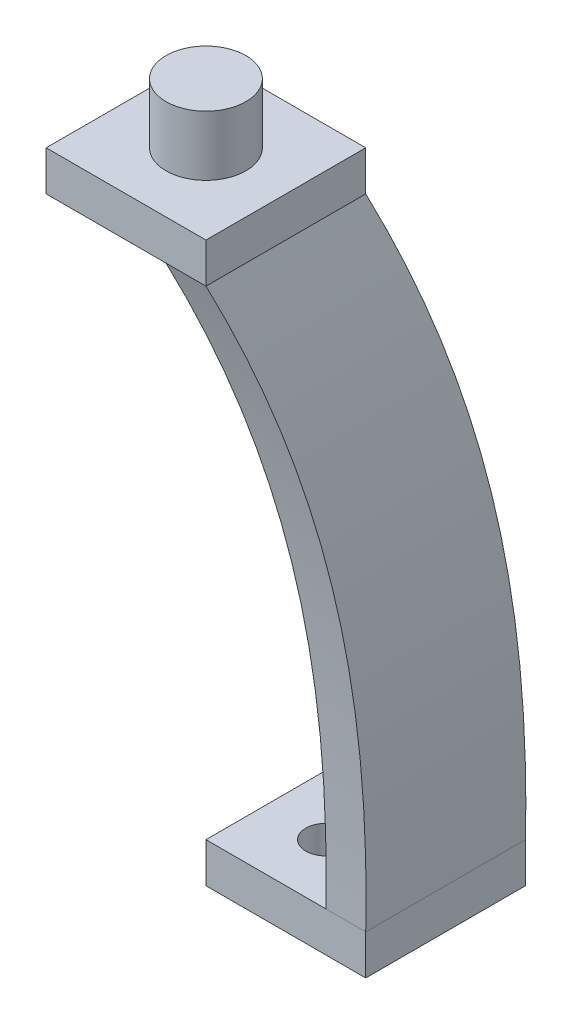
ISO-10303-21;
HEADER;
FILE_DESCRIPTION(('STEP AP214'),'2;1');
FILE_NAME('part.step','',(''),(''),'','','');
FILE_SCHEMA(('AUTOMOTIVE_DESIGN { 1 0 10303 214 1 1 1 1 }'));
ENDSEC;
DATA;
#1=APPLICATION_CONTEXT('core data for automotive mechanical design processes');
#2=APPLICATION_PROTOCOL_DEFINITION('international standard','automotive_design',2000,#1);
#3=PRODUCT_CONTEXT('',#1,'mechanical');
#4=PRODUCT('Part','Part','',(#3));
#5=PRODUCT_RELATED_PRODUCT_CATEGORY('part','',(#4));
#6=PRODUCT_DEFINITION_FORMATION('','',#4);
#7=PRODUCT_DEFINITION_CONTEXT('part definition',#1,'design');
#8=PRODUCT_DEFINITION('design','',#6,#7);
#9=PRODUCT_DEFINITION_SHAPE('','',#8);
#10=(LENGTH_UNIT() NAMED_UNIT(*) SI_UNIT(.MILLI.,.METRE.));
#11=(NAMED_UNIT(*) PLANE_ANGLE_UNIT() SI_UNIT($,.RADIAN.));
#12=(NAMED_UNIT(*) SI_UNIT($,.STERADIAN.) SOLID_ANGLE_UNIT());
#13=UNCERTAINTY_MEASURE_WITH_UNIT(LENGTH_MEASURE(1.E-05),#10,'distance_accuracy_value','');
#14=(GEOMETRIC_REPRESENTATION_CONTEXT(3) GLOBAL_UNCERTAINTY_ASSIGNED_CONTEXT((#13)) GLOBAL_UNIT_ASSIGNED_CONTEXT((#10,
#11,#12)) REPRESENTATION_CONTEXT('',''));
#15=CARTESIAN_POINT('',(0.,0.,0.));
#16=DIRECTION('',(0.,0.,1.));
#17=DIRECTION('',(1.,0.,0.));
#18=AXIS2_PLACEMENT_3D('',#15,#16,#17);
#19=CARTESIAN_POINT('',(17.7914220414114,15.4327005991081,48.4618992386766));
#20=DIRECTION('',(-1.,0.,0.));
#21=DIRECTION('',(0.,0.,1.));
#22=AXIS2_PLACEMENT_3D('',#19,#20,#21);
#23=PLANE('',#22);
#24=DIRECTION('',(0.,0.,-1.));
#25=VECTOR('',#24,1.);
#26=CARTESIAN_POINT('',(17.7914220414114,12.2577005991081,48.4618992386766));
#27=LINE('',#26,#25);
#28=CARTESIAN_POINT('',(17.7914220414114,12.2577005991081,48.4618992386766));
#29=VERTEX_POINT('',#28);
#30=CARTESIAN_POINT('',(17.7914220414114,12.2577005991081,35.7618992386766));
#31=VERTEX_POINT('',#30);
#32=EDGE_CURVE('P0_E79',#29,#31,#27,.T.);
#33=ORIENTED_EDGE('',*,*,#32,.T.);
#34=DIRECTION('',(0.,-1.,0.));
#35=VECTOR('',#34,1.);
#36=CARTESIAN_POINT('',(17.7914220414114,15.4327005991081,35.7618992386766));
#37=LINE('',#36,#35);
#38=CARTESIAN_POINT('',(17.7914220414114,15.4327005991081,35.7618992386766));
#39=VERTEX_POINT('',#38);
#40=EDGE_CURVE('P0_E10',#39,#31,#37,.T.);
#41=ORIENTED_EDGE('',*,*,#40,.F.);
#42=DIRECTION('',(0.,0.,-1.));
#43=VECTOR('',#42,1.);
#44=CARTESIAN_POINT('',(17.7914220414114,15.4327005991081,48.4618992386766));
#45=LINE('',#44,#43);
#46=CARTESIAN_POINT('',(17.7914220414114,15.4327005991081,48.4618992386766));
#47=VERTEX_POINT('',#46);
#48=EDGE_CURVE('P0_E67',#47,#39,#45,.T.);
#49=ORIENTED_EDGE('',*,*,#48,.F.);
#50=DIRECTION('',(0.,-1.,0.));
#51=VECTOR('',#50,1.);
#52=CARTESIAN_POINT('',(17.7914220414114,15.4327005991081,48.4618992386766));
#53=LINE('',#52,#51);
#54=EDGE_CURVE('P0_E75',#47,#29,#53,.T.);
#55=ORIENTED_EDGE('',*,*,#54,.T.);
#56=EDGE_LOOP('',(#33,#41,#49,#55));
#57=FACE_BOUND('',#56,.T.);
#58=ADVANCED_FACE('P0_F16',(#57),#23,.F.);
#59=CARTESIAN_POINT('',(5.09142204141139,15.4327005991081,35.7618992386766));
#60=DIRECTION('',(0.,0.,1.));
#61=DIRECTION('',(1.,0.,0.));
#62=AXIS2_PLACEMENT_3D('',#59,#60,#61);
#63=PLANE('',#62);
#64=DIRECTION('',(-1.,0.,0.));
#65=VECTOR('',#64,1.);
#66=CARTESIAN_POINT('',(5.09142204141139,12.2577005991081,35.7618992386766));
#67=LINE('',#66,#65);
#68=CARTESIAN_POINT('',(5.09142204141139,12.2577005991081,35.7618992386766));
#69=VERTEX_POINT('',#68);
#70=EDGE_CURVE('P0_E71',#31,#69,#67,.T.);
#71=ORIENTED_EDGE('',*,*,#70,.T.);
#72=DIRECTION('',(0.,-1.,0.));
#73=VECTOR('',#72,1.);
#74=CARTESIAN_POINT('',(5.09142204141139,15.4327005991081,35.7618992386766));
#75=LINE('',#74,#73);
#76=CARTESIAN_POINT('',(5.09142204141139,15.4327005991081,35.7618992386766));
#77=VERTEX_POINT('',#76);
#78=EDGE_CURVE('P0_E24',#77,#69,#75,.T.);
#79=ORIENTED_EDGE('',*,*,#78,.F.);
#80=DIRECTION('',(-1.,0.,0.));
#81=VECTOR('',#80,1.);
#82=CARTESIAN_POINT('',(5.09142204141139,15.4327005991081,35.7618992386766));
#83=LINE('',#82,#81);
#84=EDGE_CURVE('P0_E62',#39,#77,#83,.T.);
#85=ORIENTED_EDGE('',*,*,#84,.F.);
#86=ORIENTED_EDGE('',*,*,#40,.T.);
#87=EDGE_LOOP('',(#71,#79,#85,#86));
#88=FACE_BOUND('',#87,.T.);
#89=ADVANCED_FACE('P0_F70',(#88),#63,.F.);
#90=CARTESIAN_POINT('',(5.09142204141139,15.4327005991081,48.4618992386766));
#91=DIRECTION('',(1.,0.,0.));
#92=DIRECTION('',(0.,0.,-1.));
#93=AXIS2_PLACEMENT_3D('',#90,#91,#92);
#94=PLANE('',#93);
#95=DIRECTION('',(0.,0.,1.));
#96=VECTOR('',#95,1.);
#97=CARTESIAN_POINT('',(5.09142204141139,12.2577005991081,48.4618992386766));
#98=LINE('',#97,#96);
#99=CARTESIAN_POINT('',(5.09142204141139,12.2577005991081,48.4618992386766));
#100=VERTEX_POINT('',#99);
#101=EDGE_CURVE('P0_E49',#69,#100,#98,.T.);
#102=ORIENTED_EDGE('',*,*,#101,.T.);
#103=DIRECTION('',(0.,-1.,0.));
#104=VECTOR('',#103,1.);
#105=CARTESIAN_POINT('',(5.09142204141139,15.4327005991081,48.4618992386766));
#106=LINE('',#105,#104);
#107=CARTESIAN_POINT('',(5.09142204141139,15.4327005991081,48.4618992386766));
#108=VERTEX_POINT('',#107);
#109=EDGE_CURVE('P0_E72',#108,#100,#106,.T.);
#110=ORIENTED_EDGE('',*,*,#109,.F.);
#111=DIRECTION('',(0.,0.,1.));
#112=VECTOR('',#111,1.);
#113=CARTESIAN_POINT('',(5.09142204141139,15.4327005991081,48.4618992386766));
#114=LINE('',#113,#112);
#115=EDGE_CURVE('P0_E65',#77,#108,#114,.T.);
#116=ORIENTED_EDGE('',*,*,#115,.F.);
#117=ORIENTED_EDGE('',*,*,#78,.T.);
#118=EDGE_LOOP('',(#102,#110,#116,#117));
#119=FACE_BOUND('',#118,.T.);
#120=ADVANCED_FACE('P0_F73',(#119),#94,.F.);
#121=CARTESIAN_POINT('',(5.09142204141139,15.4327005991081,48.4618992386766));
#122=DIRECTION('',(0.,0.,-1.));
#123=DIRECTION('',(-1.,0.,0.));
#124=AXIS2_PLACEMENT_3D('',#121,#122,#123);
#125=PLANE('',#124);
#126=DIRECTION('',(1.,0.,0.));
#127=VECTOR('',#126,1.);
#128=CARTESIAN_POINT('',(5.09142204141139,12.2577005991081,48.4618992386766));
#129=LINE('',#128,#127);
#130=EDGE_CURVE('P0_E55',#100,#29,#129,.T.);
#131=ORIENTED_EDGE('',*,*,#130,.T.);
#132=ORIENTED_EDGE('',*,*,#54,.F.);
#133=DIRECTION('',(1.,0.,0.));
#134=VECTOR('',#133,1.);
#135=CARTESIAN_POINT('',(5.09142204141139,15.4327005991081,48.4618992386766));
#136=LINE('',#135,#134);
#137=EDGE_CURVE('P0_E32',#108,#47,#136,.T.);
#138=ORIENTED_EDGE('',*,*,#137,.F.);
#139=ORIENTED_EDGE('',*,*,#109,.T.);
#140=EDGE_LOOP('',(#131,#132,#138,#139));
#141=FACE_BOUND('',#140,.T.);
#142=ADVANCED_FACE('P0_F87',(#141),#125,.F.);
#143=CARTESIAN_POINT('',(11.4414220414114,15.4327005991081,42.1118992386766));
#144=DIRECTION('',(0.,-1.,0.));
#145=DIRECTION('',(0.,0.,-1.));
#146=AXIS2_PLACEMENT_3D('',#143,#144,#145);
#147=PLANE('',#146);
#148=CARTESIAN_POINT('',(9.85392204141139,15.4327005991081,43.6993992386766));
#149=DIRECTION('',(0.,1.,0.));
#150=DIRECTION('',(0.,0.,1.));
#151=AXIS2_PLACEMENT_3D('',#148,#149,#150);
#152=CIRCLE('',#151,1.5875);
#153=CARTESIAN_POINT('',(9.85392204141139,15.4327005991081,45.2868992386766));
#154=VERTEX_POINT('',#153);
#155=EDGE_CURVE('P0_E93',#154,#154,#152,.T.);
#156=ORIENTED_EDGE('',*,*,#155,.F.);
#157=EDGE_LOOP('',(#156));
#158=FACE_BOUND('',#157,.T.);
#159=ORIENTED_EDGE('',*,*,#48,.T.);
#160=ORIENTED_EDGE('',*,*,#84,.T.);
#161=ORIENTED_EDGE('',*,*,#115,.T.);
#162=ORIENTED_EDGE('',*,*,#137,.T.);
#163=EDGE_LOOP('',(#159,#160,#161,#162));
#164=FACE_BOUND('',#163,.T.);
#165=ADVANCED_FACE('P0_F63',(#158,#164),#147,.F.);
#166=CARTESIAN_POINT('',(11.4414220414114,12.2577005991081,42.1118992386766));
#167=DIRECTION('',(0.,-1.,0.));
#168=DIRECTION('',(0.,0.,-1.));
#169=AXIS2_PLACEMENT_3D('',#166,#167,#168);
#170=PLANE('',#169);
#171=CARTESIAN_POINT('',(9.85392204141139,12.2577005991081,43.6993992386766));
#172=DIRECTION('',(0.,1.,0.));
#173=DIRECTION('',(0.,0.,1.));
#174=AXIS2_PLACEMENT_3D('',#171,#172,#173);
#175=CIRCLE('',#174,1.5875);
#176=CARTESIAN_POINT('',(9.85392204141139,12.2577005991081,45.2868992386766));
#177=VERTEX_POINT('',#176);
#178=EDGE_CURVE('P0_E82',#177,#177,#175,.T.);
#179=ORIENTED_EDGE('',*,*,#178,.T.);
#180=EDGE_LOOP('',(#179));
#181=FACE_BOUND('',#180,.T.);
#182=ORIENTED_EDGE('',*,*,#32,.F.);
#183=ORIENTED_EDGE('',*,*,#130,.F.);
#184=ORIENTED_EDGE('',*,*,#101,.F.);
#185=ORIENTED_EDGE('',*,*,#70,.F.);
#186=EDGE_LOOP('',(#182,#183,#184,#185));
#187=FACE_BOUND('',#186,.T.);
#188=ADVANCED_FACE('P0_F90',(#181,#187),#170,.T.);
#189=CARTESIAN_POINT('',(9.85392204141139,12.2577005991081,43.6993992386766));
#190=DIRECTION('',(0.,1.,0.));
#191=DIRECTION('',(0.,0.,1.));
#192=AXIS2_PLACEMENT_3D('',#189,#190,#191);
#193=CYLINDRICAL_SURFACE('',#192,1.5875);
#194=ORIENTED_EDGE('',*,*,#178,.F.);
#195=EDGE_LOOP('',(#194));
#196=FACE_BOUND('',#195,.T.);
#197=ORIENTED_EDGE('',*,*,#155,.T.);
#198=EDGE_LOOP('',(#197));
#199=FACE_BOUND('',#198,.T.);
#200=ADVANCED_FACE('P0_F100',(#196,#199),#193,.F.);
#201=CLOSED_SHELL('',(#58,#89,#120,#142,#165,#188,#200));
#202=MANIFOLD_SOLID_BREP('P0_B1',#201);
#203=CARTESIAN_POINT('',(11.4414220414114,15.4327005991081,42.1118992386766));
#204=DIRECTION('',(0.,1.,0.));
#205=DIRECTION('',(0.,0.,1.));
#206=AXIS2_PLACEMENT_3D('',#203,#204,#205);
#207=PLANE('',#206);
#208=CARTESIAN_POINT('',(17.7914220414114,15.4327005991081,48.4618992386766));
#209=CARTESIAN_POINT('',(17.7914220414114,15.4327005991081,47.4035659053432));
#210=CARTESIAN_POINT('',(17.7914220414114,15.4327005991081,45.2868992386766));
#211=CARTESIAN_POINT('',(17.7914220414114,15.4327005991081,42.1118992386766));
#212=CARTESIAN_POINT('',(17.7914220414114,15.4327005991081,38.9368992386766));
#213=CARTESIAN_POINT('',(17.7914220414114,15.4327005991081,36.8202325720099));
#214=CARTESIAN_POINT('',(17.7914220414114,15.4327005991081,35.7618992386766));
#215=B_SPLINE_CURVE_WITH_KNOTS('',3,(#208,#209,#210,#211,#212,#213,#214),.UNSPECIFIED.,.F.,.F.,
(4,1,1,1,4),(0.,0.0625,0.125,0.1875,0.25),.UNSPECIFIED.);
#216=CARTESIAN_POINT('',(17.7914220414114,15.4327005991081,48.4618992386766));
#217=VERTEX_POINT('',#216);
#218=CARTESIAN_POINT('',(17.7914220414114,15.4327005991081,35.7618992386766));
#219=VERTEX_POINT('',#218);
#220=EDGE_CURVE('P1_E81',#217,#219,#215,.T.);
#221=ORIENTED_EDGE('',*,*,#220,.F.);
#222=CARTESIAN_POINT('',(14.6164220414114,15.4327005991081,48.4618992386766));
#223=CARTESIAN_POINT('',(14.8810053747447,15.4327005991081,48.4618992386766));
#224=CARTESIAN_POINT('',(15.4101720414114,15.4327005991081,48.4618992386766));
#225=CARTESIAN_POINT('',(16.2039220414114,15.4327005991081,48.4618992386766));
#226=CARTESIAN_POINT('',(16.9976720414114,15.4327005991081,48.4618992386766));
#227=CARTESIAN_POINT('',(17.5268387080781,15.4327005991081,48.4618992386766));
#228=CARTESIAN_POINT('',(17.7914220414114,15.4327005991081,48.4618992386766));
#229=B_SPLINE_CURVE_WITH_KNOTS('',3,(#222,#223,#224,#225,#226,#227,#228),.UNSPECIFIED.,.F.,.F.,
(4,1,1,1,4),(0.25,0.265625,0.28125,0.296875,0.3125),.UNSPECIFIED.);
#230=CARTESIAN_POINT('',(14.6164220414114,15.4327005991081,48.4618992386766));
#231=VERTEX_POINT('',#230);
#232=EDGE_CURVE('P1_E281',#231,#217,#229,.T.);
#233=ORIENTED_EDGE('',*,*,#232,.F.);
#234=CARTESIAN_POINT('',(14.6164220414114,15.4327005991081,38.9368992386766));
#235=CARTESIAN_POINT('',(14.6164220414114,15.4327005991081,39.7306492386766));
#236=CARTESIAN_POINT('',(14.6164220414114,15.4327005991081,41.3181492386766));
#237=CARTESIAN_POINT('',(14.6164220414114,15.4327005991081,43.6993992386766));
#238=CARTESIAN_POINT('',(14.6164220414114,15.4327005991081,46.0806492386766));
#239=CARTESIAN_POINT('',(14.6164220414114,15.4327005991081,47.6681492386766));
#240=CARTESIAN_POINT('',(14.6164220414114,15.4327005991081,48.4618992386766));
#241=B_SPLINE_CURVE_WITH_KNOTS('',3,(#234,#235,#236,#237,#238,#239,#240),.UNSPECIFIED.,.F.,.F.,
(4,1,1,1,4),(0.3125,0.359375,0.40625,0.453125,0.5),.UNSPECIFIED.);
#242=CARTESIAN_POINT('',(14.6164220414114,15.4327005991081,38.9368992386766));
#243=VERTEX_POINT('',#242);
#244=EDGE_CURVE('P1_E162',#243,#231,#241,.T.);
#245=ORIENTED_EDGE('',*,*,#244,.F.);
#246=CARTESIAN_POINT('',(5.09142204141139,15.4327005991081,38.9368992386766));
#247=CARTESIAN_POINT('',(5.88517204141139,15.4327005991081,38.9368992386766));
#248=CARTESIAN_POINT('',(7.47267204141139,15.4327005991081,38.9368992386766));
#249=CARTESIAN_POINT('',(9.8539220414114,15.4327005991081,38.9368992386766));
#250=CARTESIAN_POINT('',(12.2351720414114,15.4327005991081,38.9368992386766));
#251=CARTESIAN_POINT('',(13.8226720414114,15.4327005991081,38.9368992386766));
#252=CARTESIAN_POINT('',(14.6164220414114,15.4327005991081,38.9368992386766));
#253=B_SPLINE_CURVE_WITH_KNOTS('',3,(#246,#247,#248,#249,#250,#251,#252),.UNSPECIFIED.,.F.,.F.,
(4,1,1,1,4),(0.5,0.546875,0.59375,0.640625,0.6875),.UNSPECIFIED.);
#254=CARTESIAN_POINT('',(5.09142204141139,15.4327005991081,38.9368992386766));
#255=VERTEX_POINT('',#254);
#256=EDGE_CURVE('P1_E221',#255,#243,#253,.T.);
#257=ORIENTED_EDGE('',*,*,#256,.F.);
#258=CARTESIAN_POINT('',(5.09142204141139,15.4327005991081,35.7618992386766));
#259=CARTESIAN_POINT('',(5.09142204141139,15.4327005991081,36.0264825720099));
#260=CARTESIAN_POINT('',(5.09142204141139,15.4327005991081,36.5556492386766));
#261=CARTESIAN_POINT('',(5.09142204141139,15.4327005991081,37.3493992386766));
#262=CARTESIAN_POINT('',(5.09142204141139,15.4327005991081,38.1431492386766));
#263=CARTESIAN_POINT('',(5.09142204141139,15.4327005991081,38.6723159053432));
#264=CARTESIAN_POINT('',(5.09142204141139,15.4327005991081,38.9368992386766));
#265=B_SPLINE_CURVE_WITH_KNOTS('',3,(#258,#259,#260,#261,#262,#263,#264),.UNSPECIFIED.,.F.,.F.,
(4,1,1,1,4),(0.6875,0.703125,0.71875,0.734375,0.75),.UNSPECIFIED.);
#266=CARTESIAN_POINT('',(5.09142204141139,15.4327005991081,35.7618992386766));
#267=VERTEX_POINT('',#266);
#268=EDGE_CURVE('P1_E27',#267,#255,#265,.T.);
#269=ORIENTED_EDGE('',*,*,#268,.F.);
#270=CARTESIAN_POINT('',(17.7914220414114,15.4327005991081,35.7618992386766));
#271=CARTESIAN_POINT('',(16.7330887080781,15.4327005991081,35.7618992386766));
#272=CARTESIAN_POINT('',(14.6164220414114,15.4327005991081,35.7618992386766));
#273=CARTESIAN_POINT('',(11.4414220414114,15.4327005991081,35.7618992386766));
#274=CARTESIAN_POINT('',(8.26642204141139,15.4327005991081,35.7618992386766));
#275=CARTESIAN_POINT('',(6.14975537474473,15.4327005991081,35.7618992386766));
#276=CARTESIAN_POINT('',(5.09142204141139,15.4327005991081,35.7618992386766));
#277=B_SPLINE_CURVE_WITH_KNOTS('',3,(#270,#271,#272,#273,#274,#275,#276),.UNSPECIFIED.,.F.,.F.,
(4,1,1,1,4),(0.75,0.8125,0.875,0.9375,1.),.UNSPECIFIED.);
#278=EDGE_CURVE('P1_E11',#219,#267,#277,.T.);
#279=ORIENTED_EDGE('',*,*,#278,.F.);
#280=EDGE_LOOP('',(#221,#233,#245,#257,#269,#279));
#281=FACE_BOUND('',#280,.T.);
#282=ADVANCED_FACE('P1_F17',(#281),#207,.F.);
#283=CARTESIAN_POINT('',(11.4414220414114,59.8827005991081,42.1118992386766));
#284=DIRECTION('',(0.,-1.,0.));
#285=DIRECTION('',(0.,0.,-1.));
#286=AXIS2_PLACEMENT_3D('',#283,#284,#285);
#287=PLANE('',#286);
#288=CARTESIAN_POINT('',(11.4414220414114,59.8827005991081,42.1118992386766));
#289=CARTESIAN_POINT('',(11.4414220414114,59.8827005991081,43.1702325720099));
#290=CARTESIAN_POINT('',(11.4414220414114,59.8827005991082,45.2868992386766));
#291=CARTESIAN_POINT('',(11.4414220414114,59.882700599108,48.4618992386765));
#292=CARTESIAN_POINT('',(11.4414220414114,59.8827005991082,51.6368992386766));
#293=CARTESIAN_POINT('',(11.4414220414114,59.8827005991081,53.7535659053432));
#294=CARTESIAN_POINT('',(11.4414220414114,59.8827005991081,54.8118992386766));
#295=B_SPLINE_CURVE_WITH_KNOTS('',3,(#288,#289,#290,#291,#292,#293,#294),.UNSPECIFIED.,.F.,.F.,
(4,1,1,1,4),(0.,0.0625,0.125,0.1875,0.25),.UNSPECIFIED.);
#296=CARTESIAN_POINT('',(11.4414220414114,59.8827005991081,54.8118992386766));
#297=VERTEX_POINT('',#296);
#298=CARTESIAN_POINT('',(11.4414220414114,59.8827005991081,42.1118992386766));
#299=VERTEX_POINT('',#298);
#300=EDGE_CURVE('P1_E78',#297,#299,#295,.F.);
#301=ORIENTED_EDGE('',*,*,#300,.T.);
#302=CARTESIAN_POINT('',(-1.2585779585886,59.8827005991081,42.1118992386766));
#303=CARTESIAN_POINT('',(-0.20024462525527,59.8827005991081,42.1118992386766));
#304=CARTESIAN_POINT('',(1.91642204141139,59.8827005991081,42.1118992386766));
#305=CARTESIAN_POINT('',(5.0914220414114,59.8827005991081,42.1118992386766));
#306=CARTESIAN_POINT('',(8.2664220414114,59.8827005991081,42.1118992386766));
#307=CARTESIAN_POINT('',(10.3830887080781,59.8827005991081,42.1118992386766));
#308=CARTESIAN_POINT('',(11.4414220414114,59.8827005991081,42.1118992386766));
#309=B_SPLINE_CURVE_WITH_KNOTS('',3,(#302,#303,#304,#305,#306,#307,#308),.UNSPECIFIED.,.F.,.F.,
(4,1,1,1,4),(0.75,0.8125,0.875,0.9375,1.),.UNSPECIFIED.);
#310=CARTESIAN_POINT('',(-1.2585779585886,59.8827005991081,42.1118992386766));
#311=VERTEX_POINT('',#310);
#312=EDGE_CURVE('P1_E85',#299,#311,#309,.F.);
#313=ORIENTED_EDGE('',*,*,#312,.T.);
#314=CARTESIAN_POINT('',(-1.2585779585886,59.8827005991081,45.2868992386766));
#315=CARTESIAN_POINT('',(-1.2585779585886,59.8827005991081,45.0223159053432));
#316=CARTESIAN_POINT('',(-1.25857795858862,59.8827005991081,44.4931492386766));
#317=CARTESIAN_POINT('',(-1.25857795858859,59.8827005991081,43.6993992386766));
#318=CARTESIAN_POINT('',(-1.25857795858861,59.8827005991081,42.9056492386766));
#319=CARTESIAN_POINT('',(-1.25857795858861,59.8827005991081,42.3764825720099));
#320=CARTESIAN_POINT('',(-1.2585779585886,59.8827005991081,42.1118992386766));
#321=B_SPLINE_CURVE_WITH_KNOTS('',3,(#314,#315,#316,#317,#318,#319,#320),.UNSPECIFIED.,.F.,.F.,
(4,1,1,1,4),(0.6875,0.703125,0.71875,0.734375,0.75),.UNSPECIFIED.);
#322=CARTESIAN_POINT('',(-1.2585779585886,59.8827005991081,45.2868992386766));
#323=VERTEX_POINT('',#322);
#324=EDGE_CURVE('P1_E91',#311,#323,#321,.F.);
#325=ORIENTED_EDGE('',*,*,#324,.T.);
#326=CARTESIAN_POINT('',(8.2664220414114,59.8827005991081,45.2868992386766));
#327=CARTESIAN_POINT('',(7.4726720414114,59.8827005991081,45.2868992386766));
#328=CARTESIAN_POINT('',(5.88517204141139,59.8827005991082,45.2868992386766));
#329=CARTESIAN_POINT('',(3.50392204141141,59.882700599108,45.2868992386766));
#330=CARTESIAN_POINT('',(1.12267204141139,59.8827005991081,45.2868992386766));
#331=CARTESIAN_POINT('',(-0.464827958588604,59.8827005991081,45.2868992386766));
#332=CARTESIAN_POINT('',(-1.2585779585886,59.8827005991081,45.2868992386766));
#333=B_SPLINE_CURVE_WITH_KNOTS('',3,(#326,#327,#328,#329,#330,#331,#332),.UNSPECIFIED.,.F.,.F.,
(4,1,1,1,4),(0.5,0.546875,0.59375,0.640625,0.6875),.UNSPECIFIED.);
#334=CARTESIAN_POINT('',(8.2664220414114,59.8827005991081,45.2868992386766));
#335=VERTEX_POINT('',#334);
#336=EDGE_CURVE('P1_E146',#323,#335,#333,.F.);
#337=ORIENTED_EDGE('',*,*,#336,.T.);
#338=CARTESIAN_POINT('',(8.2664220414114,59.8827005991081,54.8118992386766));
#339=CARTESIAN_POINT('',(8.2664220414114,59.8827005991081,54.0181492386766));
#340=CARTESIAN_POINT('',(8.26642204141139,59.8827005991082,52.4306492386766));
#341=CARTESIAN_POINT('',(8.2664220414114,59.882700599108,50.0493992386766));
#342=CARTESIAN_POINT('',(8.2664220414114,59.8827005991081,47.6681492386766));
#343=CARTESIAN_POINT('',(8.2664220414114,59.8827005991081,46.0806492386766));
#344=CARTESIAN_POINT('',(8.2664220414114,59.8827005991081,45.2868992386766));
#345=B_SPLINE_CURVE_WITH_KNOTS('',3,(#338,#339,#340,#341,#342,#343,#344),.UNSPECIFIED.,.F.,.F.,
(4,1,1,1,4),(0.3125,0.359375,0.40625,0.453125,0.5),.UNSPECIFIED.);
#346=CARTESIAN_POINT('',(8.2664220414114,59.8827005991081,54.8118992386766));
#347=VERTEX_POINT('',#346);
#348=EDGE_CURVE('P1_E144',#335,#347,#345,.F.);
#349=ORIENTED_EDGE('',*,*,#348,.T.);
#350=CARTESIAN_POINT('',(11.4414220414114,59.8827005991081,54.8118992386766));
#351=CARTESIAN_POINT('',(11.1768387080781,59.8827005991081,54.8118992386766));
#352=CARTESIAN_POINT('',(10.6476720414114,59.8827005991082,54.8118992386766));
#353=CARTESIAN_POINT('',(9.8539220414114,59.882700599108,54.8118992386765));
#354=CARTESIAN_POINT('',(9.06017204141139,59.8827005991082,54.8118992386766));
#355=CARTESIAN_POINT('',(8.53100537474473,59.8827005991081,54.8118992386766));
#356=CARTESIAN_POINT('',(8.2664220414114,59.8827005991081,54.8118992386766));
#357=B_SPLINE_CURVE_WITH_KNOTS('',3,(#350,#351,#352,#353,#354,#355,#356),.UNSPECIFIED.,.F.,.F.,
(4,1,1,1,4),(0.25,0.265625,0.28125,0.296875,0.3125),.UNSPECIFIED.);
#358=EDGE_CURVE('P1_E96',#347,#297,#357,.F.);
#359=ORIENTED_EDGE('',*,*,#358,.T.);
#360=EDGE_LOOP('',(#301,#313,#325,#337,#349,#359));
#361=FACE_BOUND('',#360,.T.);
#362=ADVANCED_FACE('P1_F94',(#361),#287,.F.);
#363=CARTESIAN_POINT('',(-1.2585779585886,59.8827005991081,42.1118992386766));
#364=CARTESIAN_POINT('',(4.50560484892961,45.954904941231,37.5924098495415));
#365=CARTESIAN_POINT('',(5.60922898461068,31.4278798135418,35.949691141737));
#366=CARTESIAN_POINT('',(5.09142204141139,15.4327005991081,35.7618992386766));
#367=CARTESIAN_POINT('',(-0.20024462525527,59.8827005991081,42.1118992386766));
#368=CARTESIAN_POINT('',(5.56393818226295,45.954904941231,37.5924098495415));
#369=CARTESIAN_POINT('',(6.66756231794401,31.4278798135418,35.949691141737));
#370=CARTESIAN_POINT('',(6.14975537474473,15.4327005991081,35.7618992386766));
#371=CARTESIAN_POINT('',(1.91642204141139,59.8827005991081,42.1118992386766));
#372=CARTESIAN_POINT('',(7.68060484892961,45.954904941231,37.5924098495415));
#373=CARTESIAN_POINT('',(8.78422898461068,31.4278798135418,35.949691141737));
#374=CARTESIAN_POINT('',(8.26642204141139,15.4327005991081,35.7618992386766));
#375=CARTESIAN_POINT('',(5.0914220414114,59.8827005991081,42.1118992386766));
#376=CARTESIAN_POINT('',(10.8556048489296,45.9549049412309,37.5924098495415));
#377=CARTESIAN_POINT('',(11.9592289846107,31.4278798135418,35.949691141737));
#378=CARTESIAN_POINT('',(11.4414220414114,15.4327005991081,35.7618992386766));
#379=CARTESIAN_POINT('',(8.2664220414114,59.8827005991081,42.1118992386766));
#380=CARTESIAN_POINT('',(14.0306048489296,45.954904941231,37.5924098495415));
#381=CARTESIAN_POINT('',(15.1342289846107,31.4278798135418,35.949691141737));
#382=CARTESIAN_POINT('',(14.6164220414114,15.4327005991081,35.7618992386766));
#383=CARTESIAN_POINT('',(10.3830887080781,59.8827005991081,42.1118992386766));
#384=CARTESIAN_POINT('',(16.1472715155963,45.954904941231,37.5924098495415));
#385=CARTESIAN_POINT('',(17.2508956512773,31.4278798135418,35.949691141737));
#386=CARTESIAN_POINT('',(16.7330887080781,15.4327005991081,35.7618992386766));
#387=CARTESIAN_POINT('',(11.4414220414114,59.8827005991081,42.1118992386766));
#388=CARTESIAN_POINT('',(17.2056048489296,45.954904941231,37.5924098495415));
#389=CARTESIAN_POINT('',(18.3092289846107,31.4278798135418,35.949691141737));
#390=CARTESIAN_POINT('',(17.7914220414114,15.4327005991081,35.7618992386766));
#391=B_SPLINE_SURFACE_WITH_KNOTS('',3,3,((#363,#364,#365,#366),(#367,#368,#369,#370),(#371,#372,
#373,#374),(#375,#376,#377,#378),(#379,#380,#381,#382),(#383,#384,#385,#386),(#387,#388,#389,
#390)),.UNSPECIFIED.,.F.,.F.,.F.,(4,1,1,1,4),(4,4),(0.75,0.8125,0.875,0.9375,1.),(0.,1.),.UNSPECIFIED.);
#392=CARTESIAN_POINT('',(11.4414220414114,59.8827005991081,42.1118992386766));
#393=CARTESIAN_POINT('',(17.2056048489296,45.954904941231,37.5924098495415));
#394=CARTESIAN_POINT('',(18.3092289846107,31.4278798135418,35.949691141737));
#395=CARTESIAN_POINT('',(17.7914220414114,15.4327005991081,35.7618992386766));
#396=B_SPLINE_CURVE_WITH_KNOTS('',3,(#392,#393,#394,#395),.UNSPECIFIED.,.F.,.F.,(4,4),(0.,1.),.UNSPECIFIED.);
#397=EDGE_CURVE('P1_E73',#299,#219,#396,.T.);
#398=CARTESIAN_POINT('',(-1.2585779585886,59.8827005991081,42.1118992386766));
#399=CARTESIAN_POINT('',(4.50560484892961,45.954904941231,37.5924098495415));
#400=CARTESIAN_POINT('',(5.60922898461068,31.4278798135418,35.949691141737));
#401=CARTESIAN_POINT('',(5.09142204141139,15.4327005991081,35.7618992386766));
#402=B_SPLINE_CURVE_WITH_KNOTS('',3,(#398,#399,#400,#401),.UNSPECIFIED.,.F.,.F.,(4,4),(0.,1.),.UNSPECIFIED.);
#403=EDGE_CURVE('P1_E41',#311,#267,#402,.T.);
#404=ORIENTED_EDGE('',*,*,#312,.F.);
#405=ORIENTED_EDGE('',*,*,#397,.T.);
#406=ORIENTED_EDGE('',*,*,#278,.T.);
#407=ORIENTED_EDGE('',*,*,#403,.F.);
#408=EDGE_LOOP('',(#404,#405,#406,#407));
#409=FACE_BOUND('',#408,.T.);
#410=ADVANCED_FACE('P1_F87',(#409),#391,.T.);
#411=CARTESIAN_POINT('',(-1.2585779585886,59.8827005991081,45.2868992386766));
#412=CARTESIAN_POINT('',(4.50560484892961,45.954904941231,40.7674098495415));
#413=CARTESIAN_POINT('',(5.60922898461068,31.4278798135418,39.124691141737));
#414=CARTESIAN_POINT('',(5.09142204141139,15.4327005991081,38.9368992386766));
#415=CARTESIAN_POINT('',(-1.2585779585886,59.8827005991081,45.0223159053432));
#416=CARTESIAN_POINT('',(4.50560484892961,45.954904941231,40.5028265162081));
#417=CARTESIAN_POINT('',(5.60922898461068,31.4278798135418,38.8601078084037));
#418=CARTESIAN_POINT('',(5.09142204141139,15.4327005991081,38.6723159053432));
#419=CARTESIAN_POINT('',(-1.25857795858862,59.8827005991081,44.4931492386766));
#420=CARTESIAN_POINT('',(4.5056048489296,45.954904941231,39.9736598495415));
#421=CARTESIAN_POINT('',(5.60922898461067,31.4278798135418,38.330941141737));
#422=CARTESIAN_POINT('',(5.09142204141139,15.4327005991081,38.1431492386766));
#423=CARTESIAN_POINT('',(-1.25857795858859,59.8827005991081,43.6993992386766));
#424=CARTESIAN_POINT('',(4.50560484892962,45.954904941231,39.1799098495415));
#425=CARTESIAN_POINT('',(5.60922898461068,31.4278798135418,37.537191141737));
#426=CARTESIAN_POINT('',(5.09142204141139,15.4327005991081,37.3493992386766));
#427=CARTESIAN_POINT('',(-1.25857795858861,59.8827005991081,42.9056492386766));
#428=CARTESIAN_POINT('',(4.50560484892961,45.954904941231,38.3861598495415));
#429=CARTESIAN_POINT('',(5.60922898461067,31.4278798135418,36.743441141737));
#430=CARTESIAN_POINT('',(5.09142204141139,15.4327005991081,36.5556492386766));
#431=CARTESIAN_POINT('',(-1.25857795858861,59.8827005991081,42.3764825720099));
#432=CARTESIAN_POINT('',(4.50560484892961,45.954904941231,37.8569931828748));
#433=CARTESIAN_POINT('',(5.60922898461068,31.4278798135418,36.2142744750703));
#434=CARTESIAN_POINT('',(5.09142204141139,15.4327005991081,36.0264825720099));
#435=CARTESIAN_POINT('',(-1.2585779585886,59.8827005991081,42.1118992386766));
#436=CARTESIAN_POINT('',(4.50560484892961,45.954904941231,37.5924098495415));
#437=CARTESIAN_POINT('',(5.60922898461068,31.4278798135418,35.949691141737));
#438=CARTESIAN_POINT('',(5.09142204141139,15.4327005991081,35.7618992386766));
#439=B_SPLINE_SURFACE_WITH_KNOTS('',3,3,((#411,#412,#413,#414),(#415,#416,#417,#418),(#419,#420,
#421,#422),(#423,#424,#425,#426),(#427,#428,#429,#430),(#431,#432,#433,#434),(#435,#436,#437,
#438)),.UNSPECIFIED.,.F.,.F.,.F.,(4,1,1,1,4),(4,4),(0.6875,0.703125,0.71875,0.734375,0.75),(0.,
1.),.UNSPECIFIED.);
#440=CARTESIAN_POINT('',(-1.2585779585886,59.8827005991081,45.2868992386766));
#441=CARTESIAN_POINT('',(4.50560484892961,45.954904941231,40.7674098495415));
#442=CARTESIAN_POINT('',(5.60922898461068,31.4278798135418,39.124691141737));
#443=CARTESIAN_POINT('',(5.09142204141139,15.4327005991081,38.9368992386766));
#444=B_SPLINE_CURVE_WITH_KNOTS('',3,(#440,#441,#442,#443),.UNSPECIFIED.,.F.,.F.,(4,4),(0.,1.),.UNSPECIFIED.);
#445=EDGE_CURVE('P1_E166',#323,#255,#444,.T.);
#446=ORIENTED_EDGE('',*,*,#324,.F.);
#447=ORIENTED_EDGE('',*,*,#403,.T.);
#448=ORIENTED_EDGE('',*,*,#268,.T.);
#449=ORIENTED_EDGE('',*,*,#445,.F.);
#450=EDGE_LOOP('',(#446,#447,#448,#449));
#451=FACE_BOUND('',#450,.T.);
#452=ADVANCED_FACE('P1_F234',(#451),#439,.T.);
#453=CARTESIAN_POINT('',(8.2664220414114,59.8827005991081,45.2868992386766));
#454=CARTESIAN_POINT('',(14.0306048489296,45.954904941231,40.7674098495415));
#455=CARTESIAN_POINT('',(15.1342289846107,31.4278798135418,39.124691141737));
#456=CARTESIAN_POINT('',(14.6164220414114,15.4327005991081,38.9368992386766));
#457=CARTESIAN_POINT('',(7.4726720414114,59.8827005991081,45.2868992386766));
#458=CARTESIAN_POINT('',(13.2368548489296,45.954904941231,40.7674098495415));
#459=CARTESIAN_POINT('',(14.3404789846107,31.4278798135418,39.124691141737));
#460=CARTESIAN_POINT('',(13.8226720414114,15.4327005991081,38.9368992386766));
#461=CARTESIAN_POINT('',(5.88517204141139,59.8827005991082,45.2868992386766));
#462=CARTESIAN_POINT('',(11.6493548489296,45.954904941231,40.7674098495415));
#463=CARTESIAN_POINT('',(12.7529789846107,31.4278798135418,39.124691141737));
#464=CARTESIAN_POINT('',(12.2351720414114,15.4327005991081,38.9368992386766));
#465=CARTESIAN_POINT('',(3.50392204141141,59.882700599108,45.2868992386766));
#466=CARTESIAN_POINT('',(9.26810484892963,45.9549049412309,40.7674098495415));
#467=CARTESIAN_POINT('',(10.3717289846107,31.4278798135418,39.124691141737));
#468=CARTESIAN_POINT('',(9.8539220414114,15.4327005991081,38.9368992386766));
#469=CARTESIAN_POINT('',(1.12267204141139,59.8827005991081,45.2868992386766));
#470=CARTESIAN_POINT('',(6.88685484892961,45.954904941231,40.7674098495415));
#471=CARTESIAN_POINT('',(7.99047898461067,31.4278798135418,39.124691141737));
#472=CARTESIAN_POINT('',(7.47267204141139,15.4327005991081,38.9368992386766));
#473=CARTESIAN_POINT('',(-0.464827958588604,59.8827005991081,45.2868992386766));
#474=CARTESIAN_POINT('',(5.29935484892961,45.954904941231,40.7674098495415));
#475=CARTESIAN_POINT('',(6.40297898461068,31.4278798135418,39.124691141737));
#476=CARTESIAN_POINT('',(5.88517204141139,15.4327005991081,38.9368992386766));
#477=CARTESIAN_POINT('',(-1.2585779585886,59.8827005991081,45.2868992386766));
#478=CARTESIAN_POINT('',(4.50560484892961,45.954904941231,40.7674098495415));
#479=CARTESIAN_POINT('',(5.60922898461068,31.4278798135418,39.124691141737));
#480=CARTESIAN_POINT('',(5.09142204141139,15.4327005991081,38.9368992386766));
#481=B_SPLINE_SURFACE_WITH_KNOTS('',3,3,((#453,#454,#455,#456),(#457,#458,#459,#460),(#461,#462,
#463,#464),(#465,#466,#467,#468),(#469,#470,#471,#472),(#473,#474,#475,#476),(#477,#478,#479,
#480)),.UNSPECIFIED.,.F.,.F.,.F.,(4,1,1,1,4),(4,4),(0.5,0.546875,0.59375,0.640625,0.6875),(0.,
1.),.UNSPECIFIED.);
#482=CARTESIAN_POINT('',(8.2664220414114,59.8827005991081,45.2868992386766));
#483=CARTESIAN_POINT('',(14.0306048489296,45.954904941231,40.7674098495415));
#484=CARTESIAN_POINT('',(15.1342289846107,31.4278798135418,39.124691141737));
#485=CARTESIAN_POINT('',(14.6164220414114,15.4327005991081,38.9368992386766));
#486=B_SPLINE_CURVE_WITH_KNOTS('',3,(#482,#483,#484,#485),.UNSPECIFIED.,.F.,.F.,(4,4),(0.,1.),.UNSPECIFIED.);
#487=EDGE_CURVE('P1_E164',#335,#243,#486,.T.);
#488=ORIENTED_EDGE('',*,*,#336,.F.);
#489=ORIENTED_EDGE('',*,*,#445,.T.);
#490=ORIENTED_EDGE('',*,*,#256,.T.);
#491=ORIENTED_EDGE('',*,*,#487,.F.);
#492=EDGE_LOOP('',(#488,#489,#490,#491));
#493=FACE_BOUND('',#492,.T.);
#494=ADVANCED_FACE('P1_F193',(#493),#481,.T.);
#495=CARTESIAN_POINT('',(8.2664220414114,59.8827005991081,54.8118992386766));
#496=CARTESIAN_POINT('',(14.0306048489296,45.954904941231,50.2924098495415));
#497=CARTESIAN_POINT('',(15.1342289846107,31.4278798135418,48.649691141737));
#498=CARTESIAN_POINT('',(14.6164220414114,15.4327005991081,48.4618992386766));
#499=CARTESIAN_POINT('',(8.2664220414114,59.8827005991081,54.0181492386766));
#500=CARTESIAN_POINT('',(14.0306048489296,45.954904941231,49.4986598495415));
#501=CARTESIAN_POINT('',(15.1342289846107,31.4278798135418,47.855941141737));
#502=CARTESIAN_POINT('',(14.6164220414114,15.4327005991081,47.6681492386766));
#503=CARTESIAN_POINT('',(8.26642204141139,59.8827005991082,52.4306492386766));
#504=CARTESIAN_POINT('',(14.0306048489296,45.954904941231,47.9111598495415));
#505=CARTESIAN_POINT('',(15.1342289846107,31.4278798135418,46.268441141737));
#506=CARTESIAN_POINT('',(14.6164220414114,15.4327005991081,46.0806492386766));
#507=CARTESIAN_POINT('',(8.2664220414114,59.882700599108,50.0493992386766));
#508=CARTESIAN_POINT('',(14.0306048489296,45.9549049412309,45.5299098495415));
#509=CARTESIAN_POINT('',(15.1342289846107,31.4278798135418,43.887191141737));
#510=CARTESIAN_POINT('',(14.6164220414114,15.4327005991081,43.6993992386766));
#511=CARTESIAN_POINT('',(8.2664220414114,59.8827005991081,47.6681492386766));
#512=CARTESIAN_POINT('',(14.0306048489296,45.954904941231,43.1486598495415));
#513=CARTESIAN_POINT('',(15.1342289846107,31.4278798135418,41.505941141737));
#514=CARTESIAN_POINT('',(14.6164220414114,15.4327005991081,41.3181492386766));
#515=CARTESIAN_POINT('',(8.2664220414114,59.8827005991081,46.0806492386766));
#516=CARTESIAN_POINT('',(14.0306048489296,45.954904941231,41.5611598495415));
#517=CARTESIAN_POINT('',(15.1342289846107,31.4278798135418,39.918441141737));
#518=CARTESIAN_POINT('',(14.6164220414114,15.4327005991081,39.7306492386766));
#519=CARTESIAN_POINT('',(8.2664220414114,59.8827005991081,45.2868992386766));
#520=CARTESIAN_POINT('',(14.0306048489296,45.954904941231,40.7674098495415));
#521=CARTESIAN_POINT('',(15.1342289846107,31.4278798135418,39.124691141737));
#522=CARTESIAN_POINT('',(14.6164220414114,15.4327005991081,38.9368992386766));
#523=B_SPLINE_SURFACE_WITH_KNOTS('',3,3,((#495,#496,#497,#498),(#499,#500,#501,#502),(#503,#504,
#505,#506),(#507,#508,#509,#510),(#511,#512,#513,#514),(#515,#516,#517,#518),(#519,#520,#521,
#522)),.UNSPECIFIED.,.F.,.F.,.F.,(4,1,1,1,4),(4,4),(0.3125,0.359375,0.40625,0.453125,0.5),(0.,
1.),.UNSPECIFIED.);
#524=CARTESIAN_POINT('',(8.2664220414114,59.8827005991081,54.8118992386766));
#525=CARTESIAN_POINT('',(14.0306048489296,45.954904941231,50.2924098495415));
#526=CARTESIAN_POINT('',(15.1342289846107,31.4278798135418,48.649691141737));
#527=CARTESIAN_POINT('',(14.6164220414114,15.4327005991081,48.4618992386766));
#528=B_SPLINE_CURVE_WITH_KNOTS('',3,(#524,#525,#526,#527),.UNSPECIFIED.,.F.,.F.,(4,4),(0.,1.),.UNSPECIFIED.);
#529=EDGE_CURVE('P1_E156',#347,#231,#528,.T.);
#530=ORIENTED_EDGE('',*,*,#348,.F.);
#531=ORIENTED_EDGE('',*,*,#487,.T.);
#532=ORIENTED_EDGE('',*,*,#244,.T.);
#533=ORIENTED_EDGE('',*,*,#529,.F.);
#534=EDGE_LOOP('',(#530,#531,#532,#533));
#535=FACE_BOUND('',#534,.T.);
#536=ADVANCED_FACE('P1_F160',(#535),#523,.T.);
#537=CARTESIAN_POINT('',(11.4414220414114,59.8827005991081,54.8118992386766));
#538=CARTESIAN_POINT('',(17.2056048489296,45.954904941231,50.2924098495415));
#539=CARTESIAN_POINT('',(18.3092289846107,31.4278798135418,48.649691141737));
#540=CARTESIAN_POINT('',(17.7914220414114,15.4327005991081,48.4618992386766));
#541=CARTESIAN_POINT('',(11.1768387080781,59.8827005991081,54.8118992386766));
#542=CARTESIAN_POINT('',(16.9410215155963,45.954904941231,50.2924098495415));
#543=CARTESIAN_POINT('',(18.0446456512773,31.4278798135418,48.649691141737));
#544=CARTESIAN_POINT('',(17.5268387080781,15.4327005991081,48.4618992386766));
#545=CARTESIAN_POINT('',(10.6476720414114,59.8827005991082,54.8118992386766));
#546=CARTESIAN_POINT('',(16.4118548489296,45.954904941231,50.2924098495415));
#547=CARTESIAN_POINT('',(17.5154789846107,31.4278798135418,48.649691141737));
#548=CARTESIAN_POINT('',(16.9976720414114,15.4327005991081,48.4618992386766));
#549=CARTESIAN_POINT('',(9.8539220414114,59.882700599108,54.8118992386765));
#550=CARTESIAN_POINT('',(15.6181048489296,45.9549049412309,50.2924098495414));
#551=CARTESIAN_POINT('',(16.7217289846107,31.4278798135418,48.649691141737));
#552=CARTESIAN_POINT('',(16.2039220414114,15.4327005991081,48.4618992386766));
#553=CARTESIAN_POINT('',(9.06017204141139,59.8827005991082,54.8118992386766));
#554=CARTESIAN_POINT('',(14.8243548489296,45.954904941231,50.2924098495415));
#555=CARTESIAN_POINT('',(15.9279789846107,31.4278798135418,48.649691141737));
#556=CARTESIAN_POINT('',(15.4101720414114,15.4327005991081,48.4618992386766));
#557=CARTESIAN_POINT('',(8.53100537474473,59.8827005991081,54.8118992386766));
#558=CARTESIAN_POINT('',(14.2951881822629,45.954904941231,50.2924098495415));
#559=CARTESIAN_POINT('',(15.398812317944,31.4278798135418,48.649691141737));
#560=CARTESIAN_POINT('',(14.8810053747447,15.4327005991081,48.4618992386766));
#561=CARTESIAN_POINT('',(8.2664220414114,59.8827005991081,54.8118992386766));
#562=CARTESIAN_POINT('',(14.0306048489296,45.954904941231,50.2924098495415));
#563=CARTESIAN_POINT('',(15.1342289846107,31.4278798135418,48.649691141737));
#564=CARTESIAN_POINT('',(14.6164220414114,15.4327005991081,48.4618992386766));
#565=B_SPLINE_SURFACE_WITH_KNOTS('',3,3,((#537,#538,#539,#540),(#541,#542,#543,#544),(#545,#546,
#547,#548),(#549,#550,#551,#552),(#553,#554,#555,#556),(#557,#558,#559,#560),(#561,#562,#563,
#564)),.UNSPECIFIED.,.F.,.F.,.F.,(4,1,1,1,4),(4,4),(0.25,0.265625,0.28125,0.296875,0.3125),(0.,
1.),.UNSPECIFIED.);
#566=CARTESIAN_POINT('',(11.4414220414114,59.8827005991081,54.8118992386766));
#567=CARTESIAN_POINT('',(17.2056048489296,45.954904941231,50.2924098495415));
#568=CARTESIAN_POINT('',(18.3092289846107,31.4278798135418,48.649691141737));
#569=CARTESIAN_POINT('',(17.7914220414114,15.4327005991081,48.4618992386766));
#570=B_SPLINE_CURVE_WITH_KNOTS('',3,(#566,#567,#568,#569),.UNSPECIFIED.,.F.,.F.,(4,4),(0.,1.),.UNSPECIFIED.);
#571=EDGE_CURVE('P1_E90',#297,#217,#570,.T.);
#572=ORIENTED_EDGE('',*,*,#358,.F.);
#573=ORIENTED_EDGE('',*,*,#529,.T.);
#574=ORIENTED_EDGE('',*,*,#232,.T.);
#575=ORIENTED_EDGE('',*,*,#571,.F.);
#576=EDGE_LOOP('',(#572,#573,#574,#575));
#577=FACE_BOUND('',#576,.T.);
#578=ADVANCED_FACE('P1_F155',(#577),#565,.T.);
#579=CARTESIAN_POINT('',(11.4414220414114,59.8827005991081,42.1118992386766));
#580=CARTESIAN_POINT('',(17.2056048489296,45.954904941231,37.5924098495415));
#581=CARTESIAN_POINT('',(18.3092289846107,31.4278798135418,35.949691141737));
#582=CARTESIAN_POINT('',(17.7914220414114,15.4327005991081,35.7618992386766));
#583=CARTESIAN_POINT('',(11.4414220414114,59.8827005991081,43.1702325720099));
#584=CARTESIAN_POINT('',(17.2056048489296,45.954904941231,38.6507431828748));
#585=CARTESIAN_POINT('',(18.3092289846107,31.4278798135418,37.0080244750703));
#586=CARTESIAN_POINT('',(17.7914220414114,15.4327005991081,36.8202325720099));
#587=CARTESIAN_POINT('',(11.4414220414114,59.8827005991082,45.2868992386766));
#588=CARTESIAN_POINT('',(17.2056048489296,45.954904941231,40.7674098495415));
#589=CARTESIAN_POINT('',(18.3092289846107,31.4278798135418,39.124691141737));
#590=CARTESIAN_POINT('',(17.7914220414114,15.4327005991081,38.9368992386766));
#591=CARTESIAN_POINT('',(11.4414220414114,59.882700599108,48.4618992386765));
#592=CARTESIAN_POINT('',(17.2056048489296,45.9549049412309,43.9424098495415));
#593=CARTESIAN_POINT('',(18.3092289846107,31.4278798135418,42.299691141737));
#594=CARTESIAN_POINT('',(17.7914220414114,15.4327005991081,42.1118992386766));
#595=CARTESIAN_POINT('',(11.4414220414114,59.8827005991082,51.6368992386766));
#596=CARTESIAN_POINT('',(17.2056048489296,45.954904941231,47.1174098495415));
#597=CARTESIAN_POINT('',(18.3092289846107,31.4278798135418,45.474691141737));
#598=CARTESIAN_POINT('',(17.7914220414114,15.4327005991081,45.2868992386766));
#599=CARTESIAN_POINT('',(11.4414220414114,59.8827005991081,53.7535659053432));
#600=CARTESIAN_POINT('',(17.2056048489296,45.954904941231,49.2340765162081));
#601=CARTESIAN_POINT('',(18.3092289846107,31.4278798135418,47.5913578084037));
#602=CARTESIAN_POINT('',(17.7914220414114,15.4327005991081,47.4035659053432));
#603=CARTESIAN_POINT('',(11.4414220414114,59.8827005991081,54.8118992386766));
#604=CARTESIAN_POINT('',(17.2056048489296,45.954904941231,50.2924098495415));
#605=CARTESIAN_POINT('',(18.3092289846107,31.4278798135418,48.649691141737));
#606=CARTESIAN_POINT('',(17.7914220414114,15.4327005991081,48.4618992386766));
#607=B_SPLINE_SURFACE_WITH_KNOTS('',3,3,((#579,#580,#581,#582),(#583,#584,#585,#586),(#587,#588,
#589,#590),(#591,#592,#593,#594),(#595,#596,#597,#598),(#599,#600,#601,#602),(#603,#604,#605,
#606)),.UNSPECIFIED.,.F.,.F.,.F.,(4,1,1,1,4),(4,4),(0.,0.0625,0.125,0.1875,0.25),(0.,1.),.UNSPECIFIED.);
#608=ORIENTED_EDGE('',*,*,#300,.F.);
#609=ORIENTED_EDGE('',*,*,#571,.T.);
#610=ORIENTED_EDGE('',*,*,#220,.T.);
#611=ORIENTED_EDGE('',*,*,#397,.F.);
#612=EDGE_LOOP('',(#608,#609,#610,#611));
#613=FACE_BOUND('',#612,.T.);
#614=ADVANCED_FACE('P1_F75',(#613),#607,.T.);
#615=CLOSED_SHELL('',(#282,#362,#410,#452,#494,#536,#578,#614));
#616=MANIFOLD_SOLID_BREP('P1_B1',#615);
#617=CARTESIAN_POINT('',(11.4414220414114,63.0577005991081,54.8118992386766));
#618=DIRECTION('',(-1.,0.,0.));
#619=DIRECTION('',(0.,0.,1.));
#620=AXIS2_PLACEMENT_3D('',#617,#618,#619);
#621=PLANE('',#620);
#622=DIRECTION('',(0.,0.,-1.));
#623=VECTOR('',#622,1.);
#624=CARTESIAN_POINT('',(11.4414220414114,59.8827005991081,54.8118992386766));
#625=LINE('',#624,#623);
#626=CARTESIAN_POINT('',(11.4414220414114,59.8827005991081,54.8118992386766));
#627=VERTEX_POINT('',#626);
#628=CARTESIAN_POINT('',(11.4414220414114,59.8827005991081,42.1118992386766));
#629=VERTEX_POINT('',#628);
#630=EDGE_CURVE('P2_E83',#627,#629,#625,.T.);
#631=ORIENTED_EDGE('',*,*,#630,.T.);
#632=DIRECTION('',(0.,-1.,0.));
#633=VECTOR('',#632,1.);
#634=CARTESIAN_POINT('',(11.4414220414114,63.0577005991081,42.1118992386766));
#635=LINE('',#634,#633);
#636=CARTESIAN_POINT('',(11.4414220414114,63.0577005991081,42.1118992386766));
#637=VERTEX_POINT('',#636);
#638=EDGE_CURVE('P2_E20',#637,#629,#635,.T.);
#639=ORIENTED_EDGE('',*,*,#638,.F.);
#640=DIRECTION('',(0.,0.,-1.));
#641=VECTOR('',#640,1.);
#642=CARTESIAN_POINT('',(11.4414220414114,63.0577005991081,54.8118992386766));
#643=LINE('',#642,#641);
#644=CARTESIAN_POINT('',(11.4414220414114,63.0577005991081,54.8118992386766));
#645=VERTEX_POINT('',#644);
#646=EDGE_CURVE('P2_E70',#645,#637,#643,.T.);
#647=ORIENTED_EDGE('',*,*,#646,.F.);
#648=DIRECTION('',(0.,-1.,0.));
#649=VECTOR('',#648,1.);
#650=CARTESIAN_POINT('',(11.4414220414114,63.0577005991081,54.8118992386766));
#651=LINE('',#650,#649);
#652=EDGE_CURVE('P2_E79',#645,#627,#651,.T.);
#653=ORIENTED_EDGE('',*,*,#652,.T.);
#654=EDGE_LOOP('',(#631,#639,#647,#653));
#655=FACE_BOUND('',#654,.T.);
#656=ADVANCED_FACE('P2_F17',(#655),#621,.F.);
#657=CARTESIAN_POINT('',(-1.2585779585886,63.0577005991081,42.1118992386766));
#658=DIRECTION('',(0.,0.,1.));
#659=DIRECTION('',(1.,0.,0.));
#660=AXIS2_PLACEMENT_3D('',#657,#658,#659);
#661=PLANE('',#660);
#662=DIRECTION('',(-1.,0.,0.));
#663=VECTOR('',#662,1.);
#664=CARTESIAN_POINT('',(-1.2585779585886,59.8827005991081,42.1118992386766));
#665=LINE('',#664,#663);
#666=CARTESIAN_POINT('',(-1.2585779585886,59.8827005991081,42.1118992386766));
#667=VERTEX_POINT('',#666);
#668=EDGE_CURVE('P2_E75',#629,#667,#665,.T.);
#669=ORIENTED_EDGE('',*,*,#668,.T.);
#670=DIRECTION('',(0.,-1.,0.));
#671=VECTOR('',#670,1.);
#672=CARTESIAN_POINT('',(-1.2585779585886,63.0577005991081,42.1118992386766));
#673=LINE('',#672,#671);
#674=CARTESIAN_POINT('',(-1.2585779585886,63.0577005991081,42.1118992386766));
#675=VERTEX_POINT('',#674);
#676=EDGE_CURVE('P2_E73',#675,#667,#673,.T.);
#677=ORIENTED_EDGE('',*,*,#676,.F.);
#678=DIRECTION('',(-1.,0.,0.));
#679=VECTOR('',#678,1.);
#680=CARTESIAN_POINT('',(-1.2585779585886,63.0577005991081,42.1118992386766));
#681=LINE('',#680,#679);
#682=EDGE_CURVE('P2_E65',#637,#675,#681,.T.);
#683=ORIENTED_EDGE('',*,*,#682,.F.);
#684=ORIENTED_EDGE('',*,*,#638,.T.);
#685=EDGE_LOOP('',(#669,#677,#683,#684));
#686=FACE_BOUND('',#685,.T.);
#687=ADVANCED_FACE('P2_F74',(#686),#661,.F.);
#688=CARTESIAN_POINT('',(-1.2585779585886,63.0577005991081,54.8118992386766));
#689=DIRECTION('',(1.,0.,0.));
#690=DIRECTION('',(0.,0.,-1.));
#691=AXIS2_PLACEMENT_3D('',#688,#689,#690);
#692=PLANE('',#691);
#693=DIRECTION('',(0.,0.,1.));
#694=VECTOR('',#693,1.);
#695=CARTESIAN_POINT('',(-1.2585779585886,59.8827005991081,54.8118992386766));
#696=LINE('',#695,#694);
#697=CARTESIAN_POINT('',(-1.2585779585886,59.8827005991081,54.8118992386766));
#698=VERTEX_POINT('',#697);
#699=EDGE_CURVE('P2_E51',#667,#698,#696,.T.);
#700=ORIENTED_EDGE('',*,*,#699,.T.);
#701=DIRECTION('',(0.,-1.,0.));
#702=VECTOR('',#701,1.);
#703=CARTESIAN_POINT('',(-1.2585779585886,63.0577005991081,54.8118992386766));
#704=LINE('',#703,#702);
#705=CARTESIAN_POINT('',(-1.2585779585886,63.0577005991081,54.8118992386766));
#706=VERTEX_POINT('',#705);
#707=EDGE_CURVE('P2_E76',#706,#698,#704,.T.);
#708=ORIENTED_EDGE('',*,*,#707,.F.);
#709=DIRECTION('',(0.,0.,1.));
#710=VECTOR('',#709,1.);
#711=CARTESIAN_POINT('',(-1.2585779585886,63.0577005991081,54.8118992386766));
#712=LINE('',#711,#710);
#713=EDGE_CURVE('P2_E68',#675,#706,#712,.T.);
#714=ORIENTED_EDGE('',*,*,#713,.F.);
#715=ORIENTED_EDGE('',*,*,#676,.T.);
#716=EDGE_LOOP('',(#700,#708,#714,#715));
#717=FACE_BOUND('',#716,.T.);
#718=ADVANCED_FACE('P2_F77',(#717),#692,.F.);
#719=CARTESIAN_POINT('',(-1.2585779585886,63.0577005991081,54.8118992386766));
#720=DIRECTION('',(0.,0.,-1.));
#721=DIRECTION('',(-1.,0.,0.));
#722=AXIS2_PLACEMENT_3D('',#719,#720,#721);
#723=PLANE('',#722);
#724=DIRECTION('',(1.,0.,0.));
#725=VECTOR('',#724,1.);
#726=CARTESIAN_POINT('',(-1.2585779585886,59.8827005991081,54.8118992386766));
#727=LINE('',#726,#725);
#728=EDGE_CURVE('P2_E57',#698,#627,#727,.T.);
#729=ORIENTED_EDGE('',*,*,#728,.T.);
#730=ORIENTED_EDGE('',*,*,#652,.F.);
#731=DIRECTION('',(1.,0.,0.));
#732=VECTOR('',#731,1.);
#733=CARTESIAN_POINT('',(-1.2585779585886,63.0577005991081,54.8118992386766));
#734=LINE('',#733,#732);
#735=EDGE_CURVE('P2_E34',#706,#645,#734,.T.);
#736=ORIENTED_EDGE('',*,*,#735,.F.);
#737=ORIENTED_EDGE('',*,*,#707,.T.);
#738=EDGE_LOOP('',(#729,#730,#736,#737));
#739=FACE_BOUND('',#738,.T.);
#740=ADVANCED_FACE('P2_F91',(#739),#723,.F.);
#741=CARTESIAN_POINT('',(5.0914220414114,63.0577005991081,48.4618992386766));
#742=DIRECTION('',(0.,-1.,0.));
#743=DIRECTION('',(0.,0.,-1.));
#744=AXIS2_PLACEMENT_3D('',#741,#742,#743);
#745=PLANE('',#744);
#746=CARTESIAN_POINT('',(5.0914220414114,63.0577005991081,48.4618992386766));
#747=DIRECTION('',(0.,1.,0.));
#748=DIRECTION('',(0.,0.,1.));
#749=AXIS2_PLACEMENT_3D('',#746,#747,#748);
#750=CIRCLE('',#749,3.175);
#751=CARTESIAN_POINT('',(5.0914220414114,63.0577005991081,51.6368992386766));
#752=VERTEX_POINT('',#751);
#753=EDGE_CURVE('P2_E11',#752,#752,#750,.T.);
#754=ORIENTED_EDGE('',*,*,#753,.F.);
#755=EDGE_LOOP('',(#754));
#756=FACE_BOUND('',#755,.T.);
#757=ORIENTED_EDGE('',*,*,#646,.T.);
#758=ORIENTED_EDGE('',*,*,#682,.T.);
#759=ORIENTED_EDGE('',*,*,#713,.T.);
#760=ORIENTED_EDGE('',*,*,#735,.T.);
#761=EDGE_LOOP('',(#757,#758,#759,#760));
#762=FACE_BOUND('',#761,.T.);
#763=ADVANCED_FACE('P2_F66',(#756,#762),#745,.F.);
#764=CARTESIAN_POINT('',(5.0914220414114,59.8827005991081,48.4618992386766));
#765=DIRECTION('',(0.,-1.,0.));
#766=DIRECTION('',(0.,0.,-1.));
#767=AXIS2_PLACEMENT_3D('',#764,#765,#766);
#768=PLANE('',#767);
#769=ORIENTED_EDGE('',*,*,#630,.F.);
#770=ORIENTED_EDGE('',*,*,#728,.F.);
#771=ORIENTED_EDGE('',*,*,#699,.F.);
#772=ORIENTED_EDGE('',*,*,#668,.F.);
#773=EDGE_LOOP('',(#769,#770,#771,#772));
#774=FACE_BOUND('',#773,.T.);
#775=ADVANCED_FACE('P2_F94',(#774),#768,.T.);
#776=CARTESIAN_POINT('',(5.0914220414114,67.8202005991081,48.4618992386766));
#777=DIRECTION('',(0.,-1.,0.));
#778=DIRECTION('',(0.,0.,-1.));
#779=AXIS2_PLACEMENT_3D('',#776,#777,#778);
#780=CYLINDRICAL_SURFACE('',#779,3.175);
#781=CARTESIAN_POINT('',(5.0914220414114,67.8202005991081,48.4618992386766));
#782=DIRECTION('',(0.,1.,0.));
#783=DIRECTION('',(0.,0.,1.));
#784=AXIS2_PLACEMENT_3D('',#781,#782,#783);
#785=CIRCLE('',#784,3.175);
#786=CARTESIAN_POINT('',(5.0914220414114,67.8202005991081,51.6368992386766));
#787=VERTEX_POINT('',#786);
#788=EDGE_CURVE('P2_E86',#787,#787,#785,.T.);
#789=ORIENTED_EDGE('',*,*,#788,.F.);
#790=EDGE_LOOP('',(#789));
#791=FACE_BOUND('',#790,.T.);
#792=ORIENTED_EDGE('',*,*,#753,.T.);
#793=EDGE_LOOP('',(#792));
#794=FACE_BOUND('',#793,.T.);
#795=ADVANCED_FACE('P2_F102',(#791,#794),#780,.T.);
#796=CARTESIAN_POINT('',(5.0914220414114,67.8202005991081,48.4618992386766));
#797=DIRECTION('',(0.,1.,0.));
#798=DIRECTION('',(0.,0.,1.));
#799=AXIS2_PLACEMENT_3D('',#796,#797,#798);
#800=PLANE('',#799);
#801=ORIENTED_EDGE('',*,*,#788,.T.);
#802=EDGE_LOOP('',(#801));
#803=FACE_BOUND('',#802,.T.);
#804=ADVANCED_FACE('P2_F100',(#803),#800,.T.);
#805=CLOSED_SHELL('',(#656,#687,#718,#740,#763,#775,#795,#804));
#806=MANIFOLD_SOLID_BREP('P2_B1',#805);
#807=ADVANCED_BREP_SHAPE_REPRESENTATION('',(#18,#202,#616,#806),#14);
#808=SHAPE_DEFINITION_REPRESENTATION(#9,#807);
ENDSEC;
END-ISO-10303-21;
